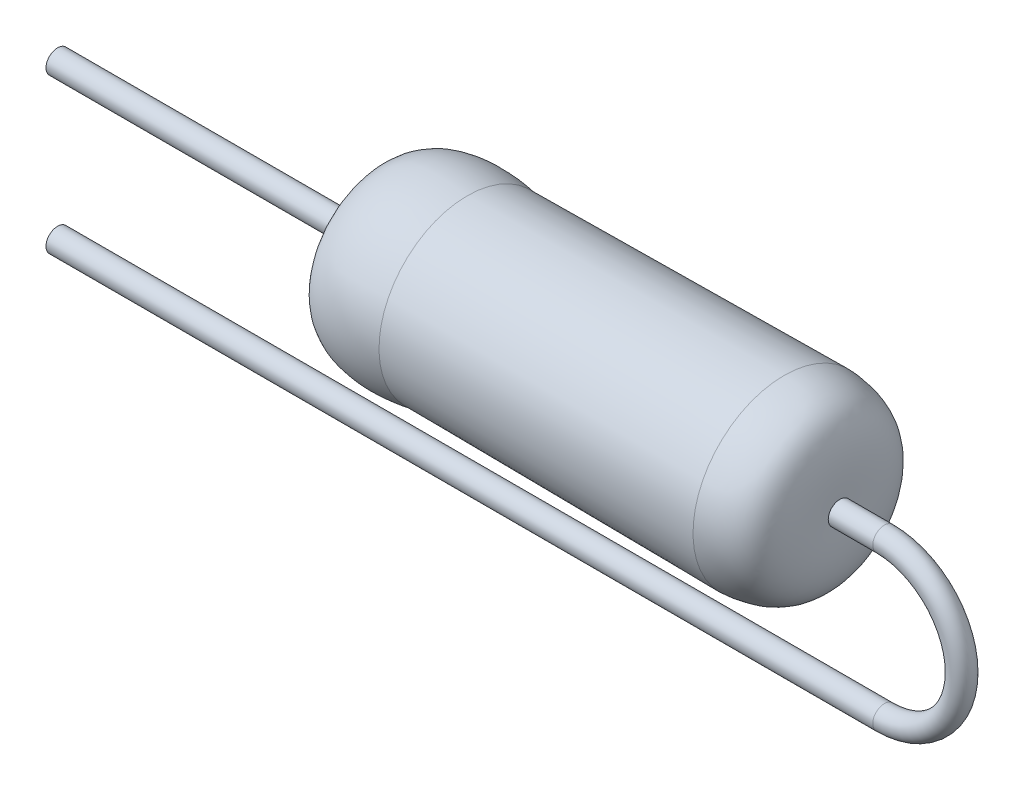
ISO-10303-21;
HEADER;
FILE_DESCRIPTION(('STEP AP214'),'2;1');
FILE_NAME('part.step','',(''),(''),'','','');
FILE_SCHEMA(('AUTOMOTIVE_DESIGN { 1 0 10303 214 1 1 1 1 }'));
ENDSEC;
DATA;
#1=APPLICATION_CONTEXT('core data for automotive mechanical design processes');
#2=APPLICATION_PROTOCOL_DEFINITION('international standard','automotive_design',2000,#1);
#3=PRODUCT_CONTEXT('',#1,'mechanical');
#4=PRODUCT('Part','Part','',(#3));
#5=PRODUCT_RELATED_PRODUCT_CATEGORY('part','',(#4));
#6=PRODUCT_DEFINITION_FORMATION('','',#4);
#7=PRODUCT_DEFINITION_CONTEXT('part definition',#1,'design');
#8=PRODUCT_DEFINITION('design','',#6,#7);
#9=PRODUCT_DEFINITION_SHAPE('','',#8);
#10=(LENGTH_UNIT() NAMED_UNIT(*) SI_UNIT(.MILLI.,.METRE.));
#11=(NAMED_UNIT(*) PLANE_ANGLE_UNIT() SI_UNIT($,.RADIAN.));
#12=(NAMED_UNIT(*) SI_UNIT($,.STERADIAN.) SOLID_ANGLE_UNIT());
#13=UNCERTAINTY_MEASURE_WITH_UNIT(LENGTH_MEASURE(1.E-05),#10,'distance_accuracy_value','');
#14=(GEOMETRIC_REPRESENTATION_CONTEXT(3) GLOBAL_UNCERTAINTY_ASSIGNED_CONTEXT((#13)) GLOBAL_UNIT_ASSIGNED_CONTEXT((#10,
#11,#12)) REPRESENTATION_CONTEXT('',''));
#15=CARTESIAN_POINT('',(0.,0.,0.));
#16=DIRECTION('',(0.,0.,1.));
#17=DIRECTION('',(1.,0.,0.));
#18=AXIS2_PLACEMENT_3D('',#15,#16,#17);
#19=CARTESIAN_POINT('',(3.1,0.,0.));
#20=DIRECTION('',(1.,0.,0.));
#21=DIRECTION('',(0.,1.,0.));
#22=AXIS2_PLACEMENT_3D('',#19,#20,#21);
#23=CYLINDRICAL_SURFACE('',#22,0.15);
#24=CARTESIAN_POINT('',(3.02359150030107,0.,0.));
#25=DIRECTION('',(1.,0.,0.));
#26=DIRECTION('',(0.,1.,0.));
#27=AXIS2_PLACEMENT_3D('',#24,#25,#26);
#28=CIRCLE('',#27,0.15);
#29=CARTESIAN_POINT('',(3.02359150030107,0.15,0.));
#30=VERTEX_POINT('',#29);
#31=EDGE_CURVE('E10',#30,#30,#28,.T.);
#32=ORIENTED_EDGE('',*,*,#31,.T.);
#33=EDGE_LOOP('',(#32));
#34=FACE_BOUND('',#33,.T.);
#35=CARTESIAN_POINT('',(3.6,0.,0.));
#36=DIRECTION('',(1.,0.,0.));
#37=DIRECTION('',(0.,0.,-1.));
#38=AXIS2_PLACEMENT_3D('',#35,#36,#37);
#39=CIRCLE('',#38,0.15);
#40=CARTESIAN_POINT('',(3.6,0.15,0.));
#41=VERTEX_POINT('',#40);
#42=EDGE_CURVE('E82',#41,#41,#39,.T.);
#43=ORIENTED_EDGE('',*,*,#42,.F.);
#44=EDGE_LOOP('',(#43));
#45=FACE_BOUND('',#44,.T.);
#46=ADVANCED_FACE('F29',(#34,#45),#23,.T.);
#47=CARTESIAN_POINT('',(3.02359150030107,0.15,0.));
#48=CARTESIAN_POINT('',(3.03906853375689,0.470693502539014,0.));
#49=CARTESIAN_POINT('',(3.04040701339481,1.04615882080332,0.));
#50=CARTESIAN_POINT('',(2.50195996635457,1.16735450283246,0.));
#51=CARTESIAN_POINT('',(2.30264580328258,1.17909283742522,0.));
#52=B_SPLINE_CURVE_WITH_KNOTS('',3,(#47,#48,#49,#50,#51),.UNSPECIFIED.,.F.,.F.,(4,1,4),
(0.575307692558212,0.791200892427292,0.932875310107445),.UNSPECIFIED.);
#53=CARTESIAN_POINT('',(3.1,0.,0.));
#54=DIRECTION('',(1.,0.,0.));
#55=AXIS1_PLACEMENT('',#53,#54);
#56=SURFACE_OF_REVOLUTION('',#52,#55);
#57=CARTESIAN_POINT('',(2.30264580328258,0.,0.));
#58=DIRECTION('',(1.,0.,0.));
#59=DIRECTION('',(0.,1.,0.));
#60=AXIS2_PLACEMENT_3D('',#57,#58,#59);
#61=CIRCLE('',#60,1.17909283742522);
#62=CARTESIAN_POINT('',(2.30264580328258,1.17909283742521,0.));
#63=VERTEX_POINT('',#62);
#64=EDGE_CURVE('E35',#63,#63,#61,.T.);
#65=ORIENTED_EDGE('',*,*,#64,.T.);
#66=EDGE_LOOP('',(#65));
#67=FACE_BOUND('',#66,.T.);
#68=ORIENTED_EDGE('',*,*,#31,.F.);
#69=EDGE_LOOP('',(#68));
#70=FACE_BOUND('',#69,.T.);
#71=ADVANCED_FACE('F70',(#67,#70),#56,.F.);
#72=CARTESIAN_POINT('',(2.30264580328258,0.,0.));
#73=DIRECTION('',(1.,0.,0.));
#74=DIRECTION('',(0.,1.,0.));
#75=AXIS2_PLACEMENT_3D('',#72,#73,#74);
#76=CONICAL_SURFACE('',#75,1.17909283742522,0.00886215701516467);
#77=CARTESIAN_POINT('',(-1.79735419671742,0.,0.));
#78=DIRECTION('',(1.,0.,0.));
#79=DIRECTION('',(0.,1.,0.));
#80=AXIS2_PLACEMENT_3D('',#77,#78,#79);
#81=CIRCLE('',#80,1.14275704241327);
#82=CARTESIAN_POINT('',(-1.79735419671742,1.14275704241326,0.));
#83=VERTEX_POINT('',#82);
#84=EDGE_CURVE('E39',#83,#83,#81,.T.);
#85=ORIENTED_EDGE('',*,*,#84,.T.);
#86=EDGE_LOOP('',(#85));
#87=FACE_BOUND('',#86,.T.);
#88=ORIENTED_EDGE('',*,*,#64,.F.);
#89=EDGE_LOOP('',(#88));
#90=FACE_BOUND('',#89,.T.);
#91=ADVANCED_FACE('F66',(#87,#90),#76,.T.);
#92=CARTESIAN_POINT('',(-1.79735419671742,1.14275704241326,0.));
#93=CARTESIAN_POINT('',(-1.96068782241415,1.17145675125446,0.));
#94=CARTESIAN_POINT('',(-2.31177453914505,1.20993253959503,0.));
#95=CARTESIAN_POINT('',(-3.04069848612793,1.04626137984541,0.));
#96=CARTESIAN_POINT('',(-3.0390580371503,0.470476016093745,0.));
#97=CARTESIAN_POINT('',(-3.02359149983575,0.15,0.));
#98=B_SPLINE_CURVE_WITH_KNOTS('',3,(#92,#93,#94,#95,#96,#97),.UNSPECIFIED.,.F.,.F.,(4,1,1,4),
(0.449746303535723,0.575550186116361,0.717128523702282,0.932875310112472),.UNSPECIFIED.);
#99=CARTESIAN_POINT('',(3.1,0.,0.));
#100=DIRECTION('',(1.,0.,0.));
#101=AXIS1_PLACEMENT('',#99,#100);
#102=SURFACE_OF_REVOLUTION('',#98,#101);
#103=CARTESIAN_POINT('',(-3.02359149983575,0.,0.));
#104=DIRECTION('',(1.,0.,0.));
#105=DIRECTION('',(0.,1.,0.));
#106=AXIS2_PLACEMENT_3D('',#103,#104,#105);
#107=CIRCLE('',#106,0.150000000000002);
#108=CARTESIAN_POINT('',(-3.02359149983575,0.15,0.));
#109=VERTEX_POINT('',#108);
#110=EDGE_CURVE('E43',#109,#109,#107,.T.);
#111=ORIENTED_EDGE('',*,*,#110,.T.);
#112=EDGE_LOOP('',(#111));
#113=FACE_BOUND('',#112,.T.);
#114=ORIENTED_EDGE('',*,*,#84,.F.);
#115=EDGE_LOOP('',(#114));
#116=FACE_BOUND('',#115,.T.);
#117=ADVANCED_FACE('F61',(#113,#116),#102,.F.);
#118=CARTESIAN_POINT('',(3.1,0.,0.));
#119=DIRECTION('',(1.,0.,0.));
#120=DIRECTION('',(0.,1.,0.));
#121=AXIS2_PLACEMENT_3D('',#118,#119,#120);
#122=CYLINDRICAL_SURFACE('',#121,0.150000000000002);
#123=ORIENTED_EDGE('',*,*,#110,.F.);
#124=EDGE_LOOP('',(#123));
#125=FACE_BOUND('',#124,.T.);
#126=CARTESIAN_POINT('',(-7.1,0.,0.));
#127=DIRECTION('',(-1.,0.,0.));
#128=DIRECTION('',(0.,-1.,0.));
#129=AXIS2_PLACEMENT_3D('',#126,#127,#128);
#130=CIRCLE('',#129,0.150000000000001);
#131=CARTESIAN_POINT('',(-7.1,-0.150000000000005,0.));
#132=VERTEX_POINT('',#131);
#133=EDGE_CURVE('E85',#132,#132,#130,.T.);
#134=ORIENTED_EDGE('',*,*,#133,.F.);
#135=EDGE_LOOP('',(#134));
#136=FACE_BOUND('',#135,.T.);
#137=ADVANCED_FACE('F65',(#125,#136),#122,.T.);
#138=CARTESIAN_POINT('',(3.6,-2.,0.));
#139=DIRECTION('',(-1.,0.,0.));
#140=DIRECTION('',(0.,-1.,0.));
#141=AXIS2_PLACEMENT_3D('',#138,#139,#140);
#142=CYLINDRICAL_SURFACE('',#141,0.15);
#143=CARTESIAN_POINT('',(3.6,-2.,0.));
#144=DIRECTION('',(-1.,0.,0.));
#145=DIRECTION('',(0.,0.,-1.));
#146=AXIS2_PLACEMENT_3D('',#143,#144,#145);
#147=CIRCLE('',#146,0.15);
#148=CARTESIAN_POINT('',(3.6,-2.15,0.));
#149=VERTEX_POINT('',#148);
#150=EDGE_CURVE('E84',#149,#149,#147,.T.);
#151=ORIENTED_EDGE('',*,*,#150,.T.);
#152=EDGE_LOOP('',(#151));
#153=FACE_BOUND('',#152,.T.);
#154=CARTESIAN_POINT('',(-7.1,-2.,0.));
#155=DIRECTION('',(-1.,0.,0.));
#156=DIRECTION('',(0.,0.,-1.));
#157=AXIS2_PLACEMENT_3D('',#154,#155,#156);
#158=CIRCLE('',#157,0.15);
#159=CARTESIAN_POINT('',(-7.1,-2.,-0.15));
#160=VERTEX_POINT('',#159);
#161=EDGE_CURVE('E48',#160,#160,#158,.T.);
#162=ORIENTED_EDGE('',*,*,#161,.F.);
#163=EDGE_LOOP('',(#162));
#164=FACE_BOUND('',#163,.T.);
#165=ADVANCED_FACE('F96',(#153,#164),#142,.T.);
#166=CARTESIAN_POINT('',(3.6,-1.,0.));
#167=DIRECTION('',(0.,0.,-1.));
#168=DIRECTION('',(-1.,0.,0.));
#169=AXIS2_PLACEMENT_3D('',#166,#167,#168);
#170=TOROIDAL_SURFACE('',#169,1.,0.15);
#171=CARTESIAN_POINT('',(3.6,-1.,0.));
#172=DIRECTION('',(0.,0.,-1.));
#173=DIRECTION('',(-1.,0.,0.));
#174=AXIS2_PLACEMENT_3D('',#171,#172,#173);
#175=CIRCLE('',#174,1.15);
#176=EDGE_CURVE('',#41,#149,#175,.T.);
#177=ORIENTED_EDGE('',*,*,#42,.T.);
#178=ORIENTED_EDGE('',*,*,#150,.F.);
#179=ORIENTED_EDGE('',*,*,#176,.T.);
#180=ORIENTED_EDGE('',*,*,#176,.F.);
#181=EDGE_LOOP('',(#177,#179,#178,#180));
#182=FACE_BOUND('',#181,.T.);
#183=ADVANCED_FACE('F98',(#182),#170,.T.);
#184=CARTESIAN_POINT('',(-7.1,-2.,0.));
#185=DIRECTION('',(-1.,0.,0.));
#186=DIRECTION('',(0.,0.,-1.));
#187=AXIS2_PLACEMENT_3D('',#184,#185,#186);
#188=PLANE('',#187);
#189=ORIENTED_EDGE('',*,*,#161,.T.);
#190=EDGE_LOOP('',(#189));
#191=FACE_BOUND('',#190,.T.);
#192=ADVANCED_FACE('F94',(#191),#188,.T.);
#193=CARTESIAN_POINT('',(-7.1,0.,0.));
#194=DIRECTION('',(-1.,0.,0.));
#195=DIRECTION('',(0.,-1.,0.));
#196=AXIS2_PLACEMENT_3D('',#193,#194,#195);
#197=PLANE('',#196);
#198=ORIENTED_EDGE('',*,*,#133,.T.);
#199=EDGE_LOOP('',(#198));
#200=FACE_BOUND('',#199,.T.);
#201=ADVANCED_FACE('F109',(#200),#197,.T.);
#202=CLOSED_SHELL('',(#46,#71,#91,#117,#137,#165,#183,#192,#201));
#203=MANIFOLD_SOLID_BREP('B2',#202);
#204=ADVANCED_BREP_SHAPE_REPRESENTATION('',(#18,#203),#14);
#205=SHAPE_DEFINITION_REPRESENTATION(#9,#204);
ENDSEC;
END-ISO-10303-21;
